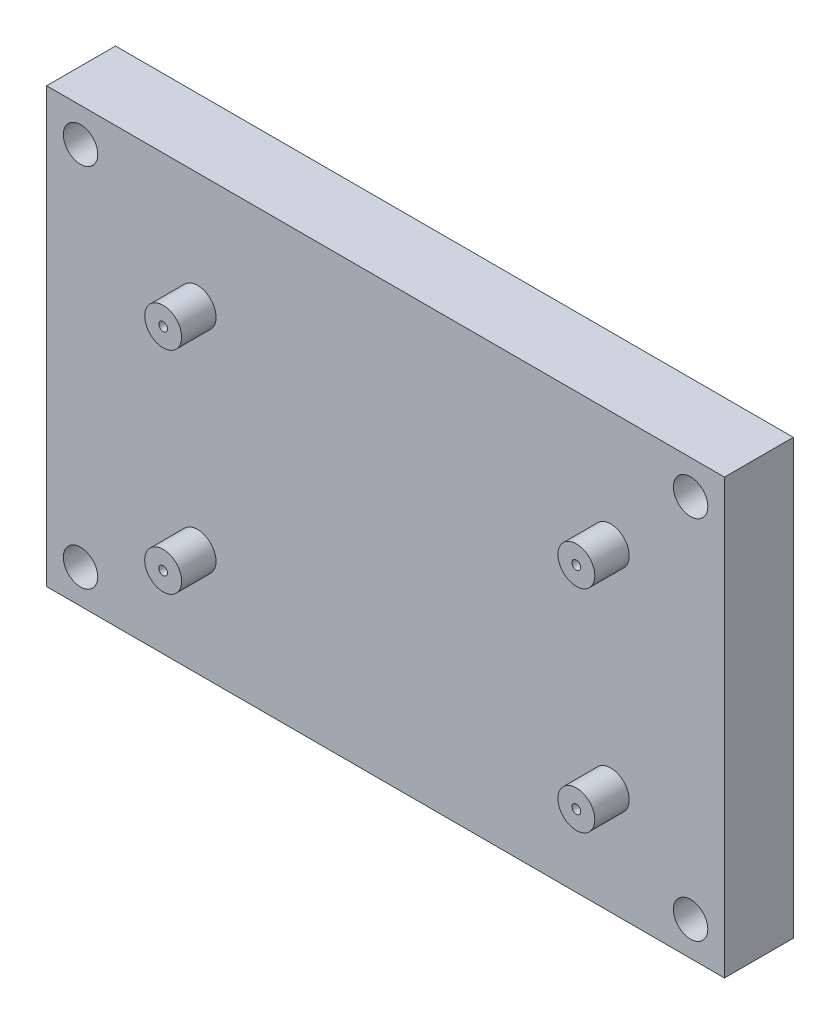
ISO-10303-21;
HEADER;
FILE_DESCRIPTION(('STEP AP214'),'2;1');
FILE_NAME('part.step','',(''),(''),'','','');
FILE_SCHEMA(('AUTOMOTIVE_DESIGN { 1 0 10303 214 1 1 1 1 }'));
ENDSEC;
DATA;
#1=APPLICATION_CONTEXT('core data for automotive mechanical design processes');
#2=APPLICATION_PROTOCOL_DEFINITION('international standard','automotive_design',2000,#1);
#3=PRODUCT_CONTEXT('',#1,'mechanical');
#4=PRODUCT('Part','Part','',(#3));
#5=PRODUCT_RELATED_PRODUCT_CATEGORY('part','',(#4));
#6=PRODUCT_DEFINITION_FORMATION('','',#4);
#7=PRODUCT_DEFINITION_CONTEXT('part definition',#1,'design');
#8=PRODUCT_DEFINITION('design','',#6,#7);
#9=PRODUCT_DEFINITION_SHAPE('','',#8);
#10=(LENGTH_UNIT() NAMED_UNIT(*) SI_UNIT(.MILLI.,.METRE.));
#11=(NAMED_UNIT(*) PLANE_ANGLE_UNIT() SI_UNIT($,.RADIAN.));
#12=(NAMED_UNIT(*) SI_UNIT($,.STERADIAN.) SOLID_ANGLE_UNIT());
#13=UNCERTAINTY_MEASURE_WITH_UNIT(LENGTH_MEASURE(1.E-05),#10,'distance_accuracy_value','');
#14=(GEOMETRIC_REPRESENTATION_CONTEXT(3) GLOBAL_UNCERTAINTY_ASSIGNED_CONTEXT((#13)) GLOBAL_UNIT_ASSIGNED_CONTEXT((#10,
#11,#12)) REPRESENTATION_CONTEXT('',''));
#15=CARTESIAN_POINT('',(0.,0.,0.));
#16=DIRECTION('',(0.,0.,1.));
#17=DIRECTION('',(1.,0.,0.));
#18=AXIS2_PLACEMENT_3D('',#15,#16,#17);
#19=CARTESIAN_POINT('',(0.,0.,12.7));
#20=DIRECTION('',(1.,0.,0.));
#21=DIRECTION('',(0.,0.,-1.));
#22=AXIS2_PLACEMENT_3D('',#19,#20,#21);
#23=PLANE('',#22);
#24=DIRECTION('',(0.,-1.,0.));
#25=VECTOR('',#24,1.);
#26=CARTESIAN_POINT('',(0.,0.,0.));
#27=LINE('',#26,#25);
#28=CARTESIAN_POINT('',(0.,80.,0.));
#29=VERTEX_POINT('',#28);
#30=CARTESIAN_POINT('',(0.,0.,0.));
#31=VERTEX_POINT('',#30);
#32=EDGE_CURVE('E111',#29,#31,#27,.T.);
#33=ORIENTED_EDGE('',*,*,#32,.T.);
#34=DIRECTION('',(0.,0.,-1.));
#35=VECTOR('',#34,1.);
#36=CARTESIAN_POINT('',(0.,0.,12.7));
#37=LINE('',#36,#35);
#38=CARTESIAN_POINT('',(0.,0.,12.7));
#39=VERTEX_POINT('',#38);
#40=EDGE_CURVE('E100',#39,#31,#37,.T.);
#41=ORIENTED_EDGE('',*,*,#40,.F.);
#42=DIRECTION('',(0.,-1.,0.));
#43=VECTOR('',#42,1.);
#44=CARTESIAN_POINT('',(0.,0.,12.7));
#45=LINE('',#44,#43);
#46=CARTESIAN_POINT('',(0.,80.,12.7));
#47=VERTEX_POINT('',#46);
#48=EDGE_CURVE('E92',#47,#39,#45,.T.);
#49=ORIENTED_EDGE('',*,*,#48,.F.);
#50=DIRECTION('',(0.,0.,-1.));
#51=VECTOR('',#50,1.);
#52=CARTESIAN_POINT('',(0.,80.,12.7));
#53=LINE('',#52,#51);
#54=EDGE_CURVE('E107',#47,#29,#53,.T.);
#55=ORIENTED_EDGE('',*,*,#54,.T.);
#56=EDGE_LOOP('',(#33,#41,#49,#55));
#57=FACE_BOUND('',#56,.T.);
#58=ADVANCED_FACE('F39',(#57),#23,.F.);
#59=CARTESIAN_POINT('',(0.,0.,12.7));
#60=DIRECTION('',(0.,1.,0.));
#61=DIRECTION('',(0.,0.,1.));
#62=AXIS2_PLACEMENT_3D('',#59,#60,#61);
#63=PLANE('',#62);
#64=DIRECTION('',(1.,0.,0.));
#65=VECTOR('',#64,1.);
#66=CARTESIAN_POINT('',(0.,0.,0.));
#67=LINE('',#66,#65);
#68=CARTESIAN_POINT('',(125.,0.,0.));
#69=VERTEX_POINT('',#68);
#70=EDGE_CURVE('E98',#31,#69,#67,.T.);
#71=ORIENTED_EDGE('',*,*,#70,.T.);
#72=DIRECTION('',(0.,0.,-1.));
#73=VECTOR('',#72,1.);
#74=CARTESIAN_POINT('',(125.,0.,12.7));
#75=LINE('',#74,#73);
#76=CARTESIAN_POINT('',(125.,0.,12.7));
#77=VERTEX_POINT('',#76);
#78=EDGE_CURVE('E96',#77,#69,#75,.T.);
#79=ORIENTED_EDGE('',*,*,#78,.F.);
#80=DIRECTION('',(1.,0.,0.));
#81=VECTOR('',#80,1.);
#82=CARTESIAN_POINT('',(0.,0.,12.7));
#83=LINE('',#82,#81);
#84=EDGE_CURVE('E87',#39,#77,#83,.T.);
#85=ORIENTED_EDGE('',*,*,#84,.F.);
#86=ORIENTED_EDGE('',*,*,#40,.T.);
#87=EDGE_LOOP('',(#71,#79,#85,#86));
#88=FACE_BOUND('',#87,.T.);
#89=ADVANCED_FACE('F97',(#88),#63,.F.);
#90=CARTESIAN_POINT('',(125.,0.,12.7));
#91=DIRECTION('',(-1.,0.,0.));
#92=DIRECTION('',(0.,0.,1.));
#93=AXIS2_PLACEMENT_3D('',#90,#91,#92);
#94=PLANE('',#93);
#95=DIRECTION('',(0.,1.,0.));
#96=VECTOR('',#95,1.);
#97=CARTESIAN_POINT('',(125.,0.,0.));
#98=LINE('',#97,#96);
#99=CARTESIAN_POINT('',(125.,80.,0.));
#100=VERTEX_POINT('',#99);
#101=EDGE_CURVE('E73',#69,#100,#98,.T.);
#102=ORIENTED_EDGE('',*,*,#101,.T.);
#103=DIRECTION('',(0.,0.,-1.));
#104=VECTOR('',#103,1.);
#105=CARTESIAN_POINT('',(125.,80.,12.7));
#106=LINE('',#105,#104);
#107=CARTESIAN_POINT('',(125.,80.,12.7));
#108=VERTEX_POINT('',#107);
#109=EDGE_CURVE('E101',#108,#100,#106,.T.);
#110=ORIENTED_EDGE('',*,*,#109,.F.);
#111=DIRECTION('',(0.,1.,0.));
#112=VECTOR('',#111,1.);
#113=CARTESIAN_POINT('',(125.,0.,12.7));
#114=LINE('',#113,#112);
#115=EDGE_CURVE('E90',#77,#108,#114,.T.);
#116=ORIENTED_EDGE('',*,*,#115,.F.);
#117=ORIENTED_EDGE('',*,*,#78,.T.);
#118=EDGE_LOOP('',(#102,#110,#116,#117));
#119=FACE_BOUND('',#118,.T.);
#120=ADVANCED_FACE('F103',(#119),#94,.F.);
#121=CARTESIAN_POINT('',(0.,80.,12.7));
#122=DIRECTION('',(0.,-1.,0.));
#123=DIRECTION('',(0.,0.,-1.));
#124=AXIS2_PLACEMENT_3D('',#121,#122,#123);
#125=PLANE('',#124);
#126=DIRECTION('',(-1.,0.,0.));
#127=VECTOR('',#126,1.);
#128=CARTESIAN_POINT('',(0.,80.,0.));
#129=LINE('',#128,#127);
#130=EDGE_CURVE('E79',#100,#29,#129,.T.);
#131=ORIENTED_EDGE('',*,*,#130,.T.);
#132=ORIENTED_EDGE('',*,*,#54,.F.);
#133=DIRECTION('',(-1.,0.,0.));
#134=VECTOR('',#133,1.);
#135=CARTESIAN_POINT('',(0.,80.,12.7));
#136=LINE('',#135,#134);
#137=EDGE_CURVE('E56',#108,#47,#136,.T.);
#138=ORIENTED_EDGE('',*,*,#137,.F.);
#139=ORIENTED_EDGE('',*,*,#109,.T.);
#140=EDGE_LOOP('',(#131,#132,#138,#139));
#141=FACE_BOUND('',#140,.T.);
#142=ADVANCED_FACE('F144',(#141),#125,.F.);
#143=CARTESIAN_POINT('',(0.,0.,12.7));
#144=DIRECTION('',(0.,0.,-1.));
#145=DIRECTION('',(-1.,0.,0.));
#146=AXIS2_PLACEMENT_3D('',#143,#144,#145);
#147=PLANE('',#146);
#148=CARTESIAN_POINT('',(104.033280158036,19.6561268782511,12.7));
#149=DIRECTION('',(0.,0.,-1.));
#150=DIRECTION('',(-1.,0.,0.));
#151=AXIS2_PLACEMENT_3D('',#148,#149,#150);
#152=CIRCLE('',#151,3.40194036);
#153=CARTESIAN_POINT('',(100.631339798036,19.6561268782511,12.7));
#154=VERTEX_POINT('',#153);
#155=EDGE_CURVE('E11',#154,#154,#152,.F.);
#156=ORIENTED_EDGE('',*,*,#155,.F.);
#157=EDGE_LOOP('',(#156));
#158=FACE_BOUND('',#157,.T.);
#159=CARTESIAN_POINT('',(27.8332801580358,19.6561268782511,12.7));
#160=DIRECTION('',(0.,0.,-1.));
#161=DIRECTION('',(-1.,0.,0.));
#162=AXIS2_PLACEMENT_3D('',#159,#160,#161);
#163=CIRCLE('',#162,3.40194036);
#164=CARTESIAN_POINT('',(24.4313397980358,19.6561268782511,12.7));
#165=VERTEX_POINT('',#164);
#166=EDGE_CURVE('E48',#165,#165,#163,.F.);
#167=ORIENTED_EDGE('',*,*,#166,.F.);
#168=EDGE_LOOP('',(#167));
#169=FACE_BOUND('',#168,.T.);
#170=CARTESIAN_POINT('',(104.036070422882,58.6361267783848,12.7));
#171=DIRECTION('',(0.,0.,-1.));
#172=DIRECTION('',(-1.,0.,0.));
#173=AXIS2_PLACEMENT_3D('',#170,#171,#172);
#174=CIRCLE('',#173,3.40194036);
#175=CARTESIAN_POINT('',(100.634130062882,58.6361267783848,12.7));
#176=VERTEX_POINT('',#175);
#177=EDGE_CURVE('E132',#176,#176,#174,.F.);
#178=ORIENTED_EDGE('',*,*,#177,.F.);
#179=EDGE_LOOP('',(#178));
#180=FACE_BOUND('',#179,.T.);
#181=CARTESIAN_POINT('',(27.8360704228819,58.6361267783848,12.7));
#182=DIRECTION('',(0.,0.,-1.));
#183=DIRECTION('',(-1.,0.,0.));
#184=AXIS2_PLACEMENT_3D('',#181,#182,#183);
#185=CIRCLE('',#184,3.40194036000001);
#186=CARTESIAN_POINT('',(24.4341300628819,58.6361267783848,12.7));
#187=VERTEX_POINT('',#186);
#188=EDGE_CURVE('E128',#187,#187,#185,.F.);
#189=ORIENTED_EDGE('',*,*,#188,.F.);
#190=EDGE_LOOP('',(#189));
#191=FACE_BOUND('',#190,.T.);
#192=CARTESIAN_POINT('',(6.25,73.75,12.7));
#193=DIRECTION('',(0.,0.,1.));
#194=DIRECTION('',(1.,0.,0.));
#195=AXIS2_PLACEMENT_3D('',#192,#193,#194);
#196=CIRCLE('',#195,3.175);
#197=CARTESIAN_POINT('',(9.425,73.75,12.7));
#198=VERTEX_POINT('',#197);
#199=EDGE_CURVE('E154',#198,#198,#196,.T.);
#200=ORIENTED_EDGE('',*,*,#199,.F.);
#201=EDGE_LOOP('',(#200));
#202=FACE_BOUND('',#201,.T.);
#203=CARTESIAN_POINT('',(118.75,6.25,12.7));
#204=DIRECTION('',(0.,0.,1.));
#205=DIRECTION('',(1.,0.,0.));
#206=AXIS2_PLACEMENT_3D('',#203,#204,#205);
#207=CIRCLE('',#206,3.175);
#208=CARTESIAN_POINT('',(121.925,6.25,12.7));
#209=VERTEX_POINT('',#208);
#210=EDGE_CURVE('E158',#209,#209,#207,.T.);
#211=ORIENTED_EDGE('',*,*,#210,.F.);
#212=EDGE_LOOP('',(#211));
#213=FACE_BOUND('',#212,.T.);
#214=CARTESIAN_POINT('',(6.25,6.25000000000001,12.7));
#215=DIRECTION('',(0.,0.,1.));
#216=DIRECTION('',(1.,0.,0.));
#217=AXIS2_PLACEMENT_3D('',#214,#215,#216);
#218=CIRCLE('',#217,3.175);
#219=CARTESIAN_POINT('',(9.425,6.25000000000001,12.7));
#220=VERTEX_POINT('',#219);
#221=EDGE_CURVE('E162',#220,#220,#218,.T.);
#222=ORIENTED_EDGE('',*,*,#221,.F.);
#223=EDGE_LOOP('',(#222));
#224=FACE_BOUND('',#223,.T.);
#225=CARTESIAN_POINT('',(118.75,73.75,12.7));
#226=DIRECTION('',(0.,0.,1.));
#227=DIRECTION('',(1.,0.,0.));
#228=AXIS2_PLACEMENT_3D('',#225,#226,#227);
#229=CIRCLE('',#228,3.175);
#230=CARTESIAN_POINT('',(121.925,73.75,12.7));
#231=VERTEX_POINT('',#230);
#232=EDGE_CURVE('E165',#231,#231,#229,.T.);
#233=ORIENTED_EDGE('',*,*,#232,.F.);
#234=EDGE_LOOP('',(#233));
#235=FACE_BOUND('',#234,.T.);
#236=ORIENTED_EDGE('',*,*,#48,.T.);
#237=ORIENTED_EDGE('',*,*,#84,.T.);
#238=ORIENTED_EDGE('',*,*,#115,.T.);
#239=ORIENTED_EDGE('',*,*,#137,.T.);
#240=EDGE_LOOP('',(#236,#237,#238,#239));
#241=FACE_BOUND('',#240,.T.);
#242=ADVANCED_FACE('F88',(#158,#169,#180,#191,#202,#213,#224,#235,#241),#147,.F.);
#243=CARTESIAN_POINT('',(0.,0.,0.));
#244=DIRECTION('',(0.,0.,-1.));
#245=DIRECTION('',(-1.,0.,0.));
#246=AXIS2_PLACEMENT_3D('',#243,#244,#245);
#247=PLANE('',#246);
#248=CARTESIAN_POINT('',(27.8360704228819,58.6361267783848,0.));
#249=DIRECTION('',(0.,0.,1.));
#250=DIRECTION('',(1.,0.,0.));
#251=AXIS2_PLACEMENT_3D('',#248,#249,#250);
#252=CIRCLE('',#251,0.806449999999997);
#253=CARTESIAN_POINT('',(28.6425204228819,58.6361267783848,0.));
#254=VERTEX_POINT('',#253);
#255=EDGE_CURVE('E232',#254,#254,#252,.T.);
#256=ORIENTED_EDGE('',*,*,#255,.T.);
#257=EDGE_LOOP('',(#256));
#258=FACE_BOUND('',#257,.T.);
#259=CARTESIAN_POINT('',(104.036070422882,58.6361267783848,0.));
#260=DIRECTION('',(0.,0.,1.));
#261=DIRECTION('',(1.,0.,0.));
#262=AXIS2_PLACEMENT_3D('',#259,#260,#261);
#263=CIRCLE('',#262,0.80645);
#264=CARTESIAN_POINT('',(104.842520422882,58.6361267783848,0.));
#265=VERTEX_POINT('',#264);
#266=EDGE_CURVE('E224',#265,#265,#263,.T.);
#267=ORIENTED_EDGE('',*,*,#266,.T.);
#268=EDGE_LOOP('',(#267));
#269=FACE_BOUND('',#268,.T.);
#270=CARTESIAN_POINT('',(27.8332801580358,19.6561268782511,0.));
#271=DIRECTION('',(0.,0.,1.));
#272=DIRECTION('',(1.,0.,0.));
#273=AXIS2_PLACEMENT_3D('',#270,#271,#272);
#274=CIRCLE('',#273,0.806449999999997);
#275=CARTESIAN_POINT('',(28.6397301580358,19.6561268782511,0.));
#276=VERTEX_POINT('',#275);
#277=EDGE_CURVE('E216',#276,#276,#274,.T.);
#278=ORIENTED_EDGE('',*,*,#277,.T.);
#279=EDGE_LOOP('',(#278));
#280=FACE_BOUND('',#279,.T.);
#281=CARTESIAN_POINT('',(104.033280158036,19.6561268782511,0.));
#282=DIRECTION('',(0.,0.,1.));
#283=DIRECTION('',(1.,0.,0.));
#284=AXIS2_PLACEMENT_3D('',#281,#282,#283);
#285=CIRCLE('',#284,0.80645);
#286=CARTESIAN_POINT('',(104.839730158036,19.6561268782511,0.));
#287=VERTEX_POINT('',#286);
#288=EDGE_CURVE('E208',#287,#287,#285,.T.);
#289=ORIENTED_EDGE('',*,*,#288,.T.);
#290=EDGE_LOOP('',(#289));
#291=FACE_BOUND('',#290,.T.);
#292=CARTESIAN_POINT('',(6.25,73.75,0.));
#293=DIRECTION('',(0.,0.,1.));
#294=DIRECTION('',(1.,0.,0.));
#295=AXIS2_PLACEMENT_3D('',#292,#293,#294);
#296=CIRCLE('',#295,3.175);
#297=CARTESIAN_POINT('',(9.425,73.75,0.));
#298=VERTEX_POINT('',#297);
#299=EDGE_CURVE('E180',#298,#298,#296,.T.);
#300=ORIENTED_EDGE('',*,*,#299,.T.);
#301=EDGE_LOOP('',(#300));
#302=FACE_BOUND('',#301,.T.);
#303=CARTESIAN_POINT('',(118.75,6.25,0.));
#304=DIRECTION('',(0.,0.,1.));
#305=DIRECTION('',(1.,0.,0.));
#306=AXIS2_PLACEMENT_3D('',#303,#304,#305);
#307=CIRCLE('',#306,3.175);
#308=CARTESIAN_POINT('',(121.925,6.25,0.));
#309=VERTEX_POINT('',#308);
#310=EDGE_CURVE('E187',#309,#309,#307,.T.);
#311=ORIENTED_EDGE('',*,*,#310,.T.);
#312=EDGE_LOOP('',(#311));
#313=FACE_BOUND('',#312,.T.);
#314=CARTESIAN_POINT('',(6.25,6.25000000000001,0.));
#315=DIRECTION('',(0.,0.,1.));
#316=DIRECTION('',(1.,0.,0.));
#317=AXIS2_PLACEMENT_3D('',#314,#315,#316);
#318=CIRCLE('',#317,3.175);
#319=CARTESIAN_POINT('',(9.425,6.25000000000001,0.));
#320=VERTEX_POINT('',#319);
#321=EDGE_CURVE('E168',#320,#320,#318,.T.);
#322=ORIENTED_EDGE('',*,*,#321,.T.);
#323=EDGE_LOOP('',(#322));
#324=FACE_BOUND('',#323,.T.);
#325=CARTESIAN_POINT('',(118.75,73.75,0.));
#326=DIRECTION('',(0.,0.,1.));
#327=DIRECTION('',(1.,0.,0.));
#328=AXIS2_PLACEMENT_3D('',#325,#326,#327);
#329=CIRCLE('',#328,3.175);
#330=CARTESIAN_POINT('',(121.925,73.75,0.));
#331=VERTEX_POINT('',#330);
#332=EDGE_CURVE('E115',#331,#331,#329,.T.);
#333=ORIENTED_EDGE('',*,*,#332,.T.);
#334=EDGE_LOOP('',(#333));
#335=FACE_BOUND('',#334,.T.);
#336=ORIENTED_EDGE('',*,*,#32,.F.);
#337=ORIENTED_EDGE('',*,*,#130,.F.);
#338=ORIENTED_EDGE('',*,*,#101,.F.);
#339=ORIENTED_EDGE('',*,*,#70,.F.);
#340=EDGE_LOOP('',(#336,#337,#338,#339));
#341=FACE_BOUND('',#340,.T.);
#342=ADVANCED_FACE('F143',(#258,#269,#280,#291,#302,#313,#324,#335,#341),#247,.T.);
#343=CARTESIAN_POINT('',(118.75,73.75,0.));
#344=DIRECTION('',(0.,0.,1.));
#345=DIRECTION('',(1.,0.,0.));
#346=AXIS2_PLACEMENT_3D('',#343,#344,#345);
#347=CYLINDRICAL_SURFACE('',#346,3.175);
#348=ORIENTED_EDGE('',*,*,#332,.F.);
#349=EDGE_LOOP('',(#348));
#350=FACE_BOUND('',#349,.T.);
#351=ORIENTED_EDGE('',*,*,#232,.T.);
#352=EDGE_LOOP('',(#351));
#353=FACE_BOUND('',#352,.T.);
#354=ADVANCED_FACE('F270',(#350,#353),#347,.F.);
#355=CARTESIAN_POINT('',(6.25,6.25000000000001,0.));
#356=DIRECTION('',(0.,0.,1.));
#357=DIRECTION('',(1.,0.,0.));
#358=AXIS2_PLACEMENT_3D('',#355,#356,#357);
#359=CYLINDRICAL_SURFACE('',#358,3.175);
#360=ORIENTED_EDGE('',*,*,#321,.F.);
#361=EDGE_LOOP('',(#360));
#362=FACE_BOUND('',#361,.T.);
#363=ORIENTED_EDGE('',*,*,#221,.T.);
#364=EDGE_LOOP('',(#363));
#365=FACE_BOUND('',#364,.T.);
#366=ADVANCED_FACE('F278',(#362,#365),#359,.F.);
#367=CARTESIAN_POINT('',(118.75,6.25,0.));
#368=DIRECTION('',(0.,0.,1.));
#369=DIRECTION('',(1.,0.,0.));
#370=AXIS2_PLACEMENT_3D('',#367,#368,#369);
#371=CYLINDRICAL_SURFACE('',#370,3.175);
#372=ORIENTED_EDGE('',*,*,#310,.F.);
#373=EDGE_LOOP('',(#372));
#374=FACE_BOUND('',#373,.T.);
#375=ORIENTED_EDGE('',*,*,#210,.T.);
#376=EDGE_LOOP('',(#375));
#377=FACE_BOUND('',#376,.T.);
#378=ADVANCED_FACE('F258',(#374,#377),#371,.F.);
#379=CARTESIAN_POINT('',(6.25,73.75,0.));
#380=DIRECTION('',(0.,0.,1.));
#381=DIRECTION('',(1.,0.,0.));
#382=AXIS2_PLACEMENT_3D('',#379,#380,#381);
#383=CYLINDRICAL_SURFACE('',#382,3.175);
#384=ORIENTED_EDGE('',*,*,#299,.F.);
#385=EDGE_LOOP('',(#384));
#386=FACE_BOUND('',#385,.T.);
#387=ORIENTED_EDGE('',*,*,#199,.T.);
#388=EDGE_LOOP('',(#387));
#389=FACE_BOUND('',#388,.T.);
#390=ADVANCED_FACE('F253',(#386,#389),#383,.F.);
#391=CARTESIAN_POINT('',(27.8360704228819,58.6361267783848,19.05));
#392=DIRECTION('',(0.,0.,-1.));
#393=DIRECTION('',(-1.,0.,0.));
#394=AXIS2_PLACEMENT_3D('',#391,#392,#393);
#395=CYLINDRICAL_SURFACE('',#394,3.40194036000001);
#396=CARTESIAN_POINT('',(27.8360704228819,58.6361267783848,19.05));
#397=DIRECTION('',(0.,0.,1.));
#398=DIRECTION('',(1.,0.,0.));
#399=AXIS2_PLACEMENT_3D('',#396,#397,#398);
#400=CIRCLE('',#399,3.40194036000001);
#401=CARTESIAN_POINT('',(31.2380107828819,58.6361267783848,19.05));
#402=VERTEX_POINT('',#401);
#403=EDGE_CURVE('E181',#402,#402,#400,.T.);
#404=ORIENTED_EDGE('',*,*,#403,.F.);
#405=EDGE_LOOP('',(#404));
#406=FACE_BOUND('',#405,.T.);
#407=ORIENTED_EDGE('',*,*,#188,.T.);
#408=EDGE_LOOP('',(#407));
#409=FACE_BOUND('',#408,.T.);
#410=ADVANCED_FACE('F247',(#406,#409),#395,.T.);
#411=CARTESIAN_POINT('',(27.8360704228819,58.6361267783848,19.05));
#412=DIRECTION('',(0.,0.,1.));
#413=DIRECTION('',(1.,0.,0.));
#414=AXIS2_PLACEMENT_3D('',#411,#412,#413);
#415=PLANE('',#414);
#416=CARTESIAN_POINT('',(27.8360704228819,58.6361267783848,19.05));
#417=DIRECTION('',(0.,0.,1.));
#418=DIRECTION('',(1.,0.,0.));
#419=AXIS2_PLACEMENT_3D('',#416,#417,#418);
#420=CIRCLE('',#419,0.806449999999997);
#421=CARTESIAN_POINT('',(28.6425204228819,58.6361267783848,19.05));
#422=VERTEX_POINT('',#421);
#423=EDGE_CURVE('E236',#422,#422,#420,.T.);
#424=ORIENTED_EDGE('',*,*,#423,.F.);
#425=EDGE_LOOP('',(#424));
#426=FACE_BOUND('',#425,.T.);
#427=ORIENTED_EDGE('',*,*,#403,.T.);
#428=EDGE_LOOP('',(#427));
#429=FACE_BOUND('',#428,.T.);
#430=ADVANCED_FACE('F243',(#426,#429),#415,.T.);
#431=CARTESIAN_POINT('',(104.036070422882,58.6361267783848,19.05));
#432=DIRECTION('',(0.,0.,-1.));
#433=DIRECTION('',(-1.,0.,0.));
#434=AXIS2_PLACEMENT_3D('',#431,#432,#433);
#435=CYLINDRICAL_SURFACE('',#434,3.40194036);
#436=CARTESIAN_POINT('',(104.036070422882,58.6361267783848,19.05));
#437=DIRECTION('',(0.,0.,1.));
#438=DIRECTION('',(1.,0.,0.));
#439=AXIS2_PLACEMENT_3D('',#436,#437,#438);
#440=CIRCLE('',#439,3.40194036);
#441=CARTESIAN_POINT('',(107.438010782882,58.6361267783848,19.05));
#442=VERTEX_POINT('',#441);
#443=EDGE_CURVE('E196',#442,#442,#440,.T.);
#444=ORIENTED_EDGE('',*,*,#443,.F.);
#445=EDGE_LOOP('',(#444));
#446=FACE_BOUND('',#445,.T.);
#447=ORIENTED_EDGE('',*,*,#177,.T.);
#448=EDGE_LOOP('',(#447));
#449=FACE_BOUND('',#448,.T.);
#450=ADVANCED_FACE('F246',(#446,#449),#435,.T.);
#451=CARTESIAN_POINT('',(104.036070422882,58.6361267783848,19.05));
#452=DIRECTION('',(0.,0.,1.));
#453=DIRECTION('',(1.,0.,0.));
#454=AXIS2_PLACEMENT_3D('',#451,#452,#453);
#455=PLANE('',#454);
#456=CARTESIAN_POINT('',(104.036070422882,58.6361267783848,19.05));
#457=DIRECTION('',(0.,0.,1.));
#458=DIRECTION('',(1.,0.,0.));
#459=AXIS2_PLACEMENT_3D('',#456,#457,#458);
#460=CIRCLE('',#459,0.80645);
#461=CARTESIAN_POINT('',(104.842520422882,58.6361267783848,19.05));
#462=VERTEX_POINT('',#461);
#463=EDGE_CURVE('E228',#462,#462,#460,.T.);
#464=ORIENTED_EDGE('',*,*,#463,.F.);
#465=EDGE_LOOP('',(#464));
#466=FACE_BOUND('',#465,.T.);
#467=ORIENTED_EDGE('',*,*,#443,.T.);
#468=EDGE_LOOP('',(#467));
#469=FACE_BOUND('',#468,.T.);
#470=ADVANCED_FACE('F346',(#466,#469),#455,.T.);
#471=CARTESIAN_POINT('',(27.8332801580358,19.6561268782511,19.05));
#472=DIRECTION('',(0.,0.,-1.));
#473=DIRECTION('',(-1.,0.,0.));
#474=AXIS2_PLACEMENT_3D('',#471,#472,#473);
#475=CYLINDRICAL_SURFACE('',#474,3.40194036);
#476=CARTESIAN_POINT('',(27.8332801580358,19.6561268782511,19.05));
#477=DIRECTION('',(0.,0.,1.));
#478=DIRECTION('',(1.,0.,0.));
#479=AXIS2_PLACEMENT_3D('',#476,#477,#478);
#480=CIRCLE('',#479,3.40194036);
#481=CARTESIAN_POINT('',(31.2352205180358,19.6561268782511,19.05));
#482=VERTEX_POINT('',#481);
#483=EDGE_CURVE('E200',#482,#482,#480,.T.);
#484=ORIENTED_EDGE('',*,*,#483,.F.);
#485=EDGE_LOOP('',(#484));
#486=FACE_BOUND('',#485,.T.);
#487=ORIENTED_EDGE('',*,*,#166,.T.);
#488=EDGE_LOOP('',(#487));
#489=FACE_BOUND('',#488,.T.);
#490=ADVANCED_FACE('F139',(#486,#489),#475,.T.);
#491=CARTESIAN_POINT('',(27.8332801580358,19.6561268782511,19.05));
#492=DIRECTION('',(0.,0.,1.));
#493=DIRECTION('',(1.,0.,0.));
#494=AXIS2_PLACEMENT_3D('',#491,#492,#493);
#495=PLANE('',#494);
#496=CARTESIAN_POINT('',(27.8332801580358,19.6561268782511,19.05));
#497=DIRECTION('',(0.,0.,1.));
#498=DIRECTION('',(1.,0.,0.));
#499=AXIS2_PLACEMENT_3D('',#496,#497,#498);
#500=CIRCLE('',#499,0.806449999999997);
#501=CARTESIAN_POINT('',(28.6397301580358,19.6561268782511,19.05));
#502=VERTEX_POINT('',#501);
#503=EDGE_CURVE('E220',#502,#502,#500,.T.);
#504=ORIENTED_EDGE('',*,*,#503,.F.);
#505=EDGE_LOOP('',(#504));
#506=FACE_BOUND('',#505,.T.);
#507=ORIENTED_EDGE('',*,*,#483,.T.);
#508=EDGE_LOOP('',(#507));
#509=FACE_BOUND('',#508,.T.);
#510=ADVANCED_FACE('F363',(#506,#509),#495,.T.);
#511=CARTESIAN_POINT('',(104.033280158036,19.6561268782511,19.05));
#512=DIRECTION('',(0.,0.,-1.));
#513=DIRECTION('',(-1.,0.,0.));
#514=AXIS2_PLACEMENT_3D('',#511,#512,#513);
#515=CYLINDRICAL_SURFACE('',#514,3.40194036);
#516=CARTESIAN_POINT('',(104.033280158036,19.6561268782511,19.05));
#517=DIRECTION('',(0.,0.,1.));
#518=DIRECTION('',(1.,0.,0.));
#519=AXIS2_PLACEMENT_3D('',#516,#517,#518);
#520=CIRCLE('',#519,3.40194036);
#521=CARTESIAN_POINT('',(107.435220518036,19.6561268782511,19.05));
#522=VERTEX_POINT('',#521);
#523=EDGE_CURVE('E204',#522,#522,#520,.T.);
#524=ORIENTED_EDGE('',*,*,#523,.F.);
#525=EDGE_LOOP('',(#524));
#526=FACE_BOUND('',#525,.T.);
#527=ORIENTED_EDGE('',*,*,#155,.T.);
#528=EDGE_LOOP('',(#527));
#529=FACE_BOUND('',#528,.T.);
#530=ADVANCED_FACE('F371',(#526,#529),#515,.T.);
#531=CARTESIAN_POINT('',(104.033280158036,19.6561268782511,19.05));
#532=DIRECTION('',(0.,0.,1.));
#533=DIRECTION('',(1.,0.,0.));
#534=AXIS2_PLACEMENT_3D('',#531,#532,#533);
#535=PLANE('',#534);
#536=CARTESIAN_POINT('',(104.033280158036,19.6561268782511,19.05));
#537=DIRECTION('',(0.,0.,1.));
#538=DIRECTION('',(1.,0.,0.));
#539=AXIS2_PLACEMENT_3D('',#536,#537,#538);
#540=CIRCLE('',#539,0.80645);
#541=CARTESIAN_POINT('',(104.839730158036,19.6561268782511,19.05));
#542=VERTEX_POINT('',#541);
#543=EDGE_CURVE('E212',#542,#542,#540,.T.);
#544=ORIENTED_EDGE('',*,*,#543,.F.);
#545=EDGE_LOOP('',(#544));
#546=FACE_BOUND('',#545,.T.);
#547=ORIENTED_EDGE('',*,*,#523,.T.);
#548=EDGE_LOOP('',(#547));
#549=FACE_BOUND('',#548,.T.);
#550=ADVANCED_FACE('F380',(#546,#549),#535,.T.);
#551=CARTESIAN_POINT('',(104.033280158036,19.6561268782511,19.05));
#552=DIRECTION('',(0.,0.,1.));
#553=DIRECTION('',(1.,0.,0.));
#554=AXIS2_PLACEMENT_3D('',#551,#552,#553);
#555=CYLINDRICAL_SURFACE('',#554,0.80645);
#556=ORIENTED_EDGE('',*,*,#288,.F.);
#557=EDGE_LOOP('',(#556));
#558=FACE_BOUND('',#557,.T.);
#559=ORIENTED_EDGE('',*,*,#543,.T.);
#560=EDGE_LOOP('',(#559));
#561=FACE_BOUND('',#560,.T.);
#562=ADVANCED_FACE('F388',(#558,#561),#555,.F.);
#563=CARTESIAN_POINT('',(27.8332801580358,19.6561268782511,19.05));
#564=DIRECTION('',(0.,0.,1.));
#565=DIRECTION('',(1.,0.,0.));
#566=AXIS2_PLACEMENT_3D('',#563,#564,#565);
#567=CYLINDRICAL_SURFACE('',#566,0.806449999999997);
#568=ORIENTED_EDGE('',*,*,#277,.F.);
#569=EDGE_LOOP('',(#568));
#570=FACE_BOUND('',#569,.T.);
#571=ORIENTED_EDGE('',*,*,#503,.T.);
#572=EDGE_LOOP('',(#571));
#573=FACE_BOUND('',#572,.T.);
#574=ADVANCED_FACE('F397',(#570,#573),#567,.F.);
#575=CARTESIAN_POINT('',(104.036070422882,58.6361267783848,19.05));
#576=DIRECTION('',(0.,0.,1.));
#577=DIRECTION('',(1.,0.,0.));
#578=AXIS2_PLACEMENT_3D('',#575,#576,#577);
#579=CYLINDRICAL_SURFACE('',#578,0.80645);
#580=ORIENTED_EDGE('',*,*,#266,.F.);
#581=EDGE_LOOP('',(#580));
#582=FACE_BOUND('',#581,.T.);
#583=ORIENTED_EDGE('',*,*,#463,.T.);
#584=EDGE_LOOP('',(#583));
#585=FACE_BOUND('',#584,.T.);
#586=ADVANCED_FACE('F406',(#582,#585),#579,.F.);
#587=CARTESIAN_POINT('',(27.8360704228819,58.6361267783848,19.05));
#588=DIRECTION('',(0.,0.,1.));
#589=DIRECTION('',(1.,0.,0.));
#590=AXIS2_PLACEMENT_3D('',#587,#588,#589);
#591=CYLINDRICAL_SURFACE('',#590,0.806449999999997);
#592=ORIENTED_EDGE('',*,*,#255,.F.);
#593=EDGE_LOOP('',(#592));
#594=FACE_BOUND('',#593,.T.);
#595=ORIENTED_EDGE('',*,*,#423,.T.);
#596=EDGE_LOOP('',(#595));
#597=FACE_BOUND('',#596,.T.);
#598=ADVANCED_FACE('F241',(#594,#597),#591,.F.);
#599=CLOSED_SHELL('',(#58,#89,#120,#142,#242,#342,#354,#366,#378,#390,#410,#430,#450,#470,#490,
#510,#530,#550,#562,#574,#586,#598));
#600=MANIFOLD_SOLID_BREP('B2',#599);
#601=ADVANCED_BREP_SHAPE_REPRESENTATION('',(#18,#600),#14);
#602=SHAPE_DEFINITION_REPRESENTATION(#9,#601);
ENDSEC;
END-ISO-10303-21;
